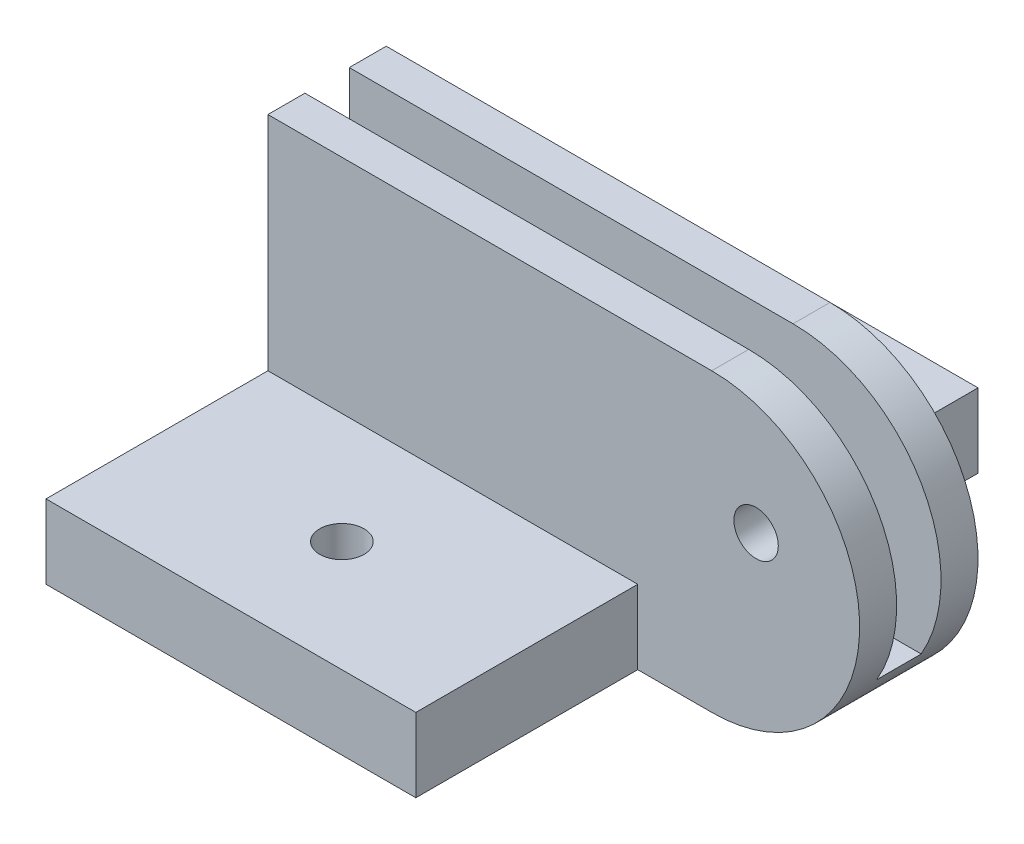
from build123d import *

# Parameters (mm, degrees)
SALIENTE_EXTRUIR1_DEPTH = 8
CROQUIS2_W              = 25
CROQUIS2_H              = 15
SALIENTE_EXTRUIR2_DEPTH = 5
CROQUIS5_W              = 40
CROQUIS5_H              = 3
CORTAR_EXTRUIR5_DEPTH   = 15
CROQUIS8_R              = 1.5
CORTAR_EXTRUIR6_DEPTH   = 40.102429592
CROQUIS9_R              = 1.5
CORTAR_EXTRUIR7_DEPTH   = 41.669398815


with BuildPart() as part:
    # Croquis1 → Saliente-Extruir1 (new body)
    with BuildSketch(Plane.XY):
        with BuildLine():
            Line((-30, 10), (0, 10))
            ThreePointArc((0, 10), (10, 0), (0, -10))
            Line((0, -10), (-30, -10))
            Line((-30, -10), (-30, 10))
        make_face()
    extrude(amount=SALIENTE_EXTRUIR1_DEPTH)

    # Croquis2 → Saliente-Extruir2 (add)
    with BuildSketch(Plane.XZ.offset(10)):
        with Locations((-17.5, -7.5)):
            Rectangle(CROQUIS2_W, CROQUIS2_H)
        with Locations((-17.5, 15.5)):
            Rectangle(CROQUIS2_W, CROQUIS2_H)
    extrude(amount=-SALIENTE_EXTRUIR2_DEPTH)

    # Croquis5 → Cortar-Extruir5 (cut)
    with BuildSketch(Plane(origin=(0, 10, 0), x_dir=(1, 0, 0), z_dir=(0, 1, 0))):
        with Locations((-10, -4)):
            Rectangle(CROQUIS5_W, CROQUIS5_H)
    extrude(amount=-CORTAR_EXTRUIR5_DEPTH, mode=Mode.SUBTRACT)

    # Croquis8 → Cortar-Extruir6 (cut, through all)
    with BuildSketch(Plane.XY.offset(8)):
        with Locations((3, 2)):
            Circle(CROQUIS8_R)
    extrude(amount=-CORTAR_EXTRUIR6_DEPTH, mode=Mode.SUBTRACT)

    # Croquis9 → Cortar-Extruir7 (cut, through all)
    with BuildSketch(Plane(origin=(0, -5, 0), x_dir=(1, 0, 0), z_dir=(0, 1, 0))):
        with Locations(Location((-17.5, 7.5, 0), (0, 0, 270))):
            Circle(CROQUIS9_R)
        with Locations(Location((-17.5, -15.5, 0), (0, 0, 270))):
            Circle(CROQUIS9_R)
    extrude(amount=-CORTAR_EXTRUIR7_DEPTH, mode=Mode.SUBTRACT)


solid = part.part
